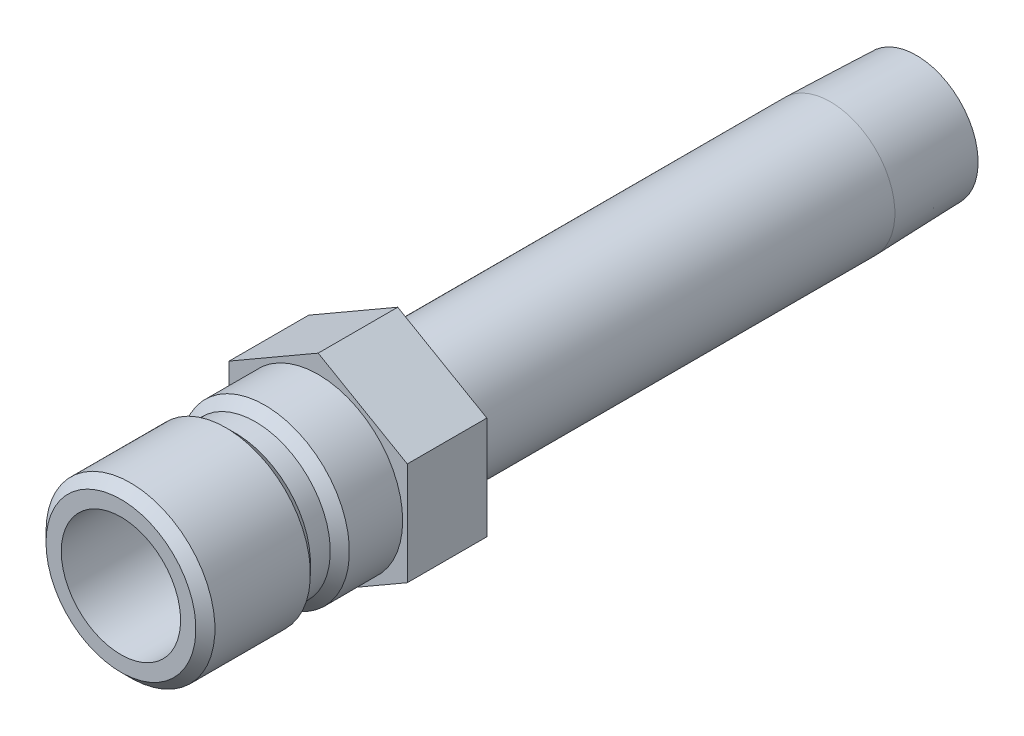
from build123d import *

# Parameters (mm, degrees)
SKETCH2_R           = 4.7625
BOSS_EXTRUDE1_DEPTH = 6.35


with BuildPart() as part:
    # Sketch1 → Revolve1 (revolve)
    with BuildSketch(Plane(origin=(0, 0, 0), x_dir=(0, 0, -1), z_dir=(1, 0, 0)), mode=Mode.PRIVATE) as revolve1_sk:
        Polygon((-15.748, 4.7625), (-15.748, 5.9817), (-14.986, 6.7437), (-7.366, 6.7437), (-6.604, 5.9817), (-5.0165, 5.9817), (-4.2545, 6.7437), (6.35, 6.7437), (6.35, 5.1435), (40.894, 5.1435), (47.752, 4.929188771), (47.752, 3.4163), (-2.840212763, 3.4163), (-3.556, 4.7625), align=None)
    revolve(revolve1_sk.sketch.rotate(Axis((0, 0, -6.35), (0, 0, 1)), 90), axis=Axis((0, 0, -6.35), (0, 0, 1)))

    # Sketch2 → Boss-Extrude1 (add)
    with BuildSketch(Plane.XY):
        Polygon((-7.112, 4.106115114), (-7.112, -4.106115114), (0, -8.212230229), (7.112, -4.106115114), (7.112, 4.106115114), (0, 8.212230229), align=None)
        with Locations(Location((0, 0, 0), (0, 0, 180))):
            Circle(SKETCH2_R, mode=Mode.SUBTRACT)
    extrude(amount=-BOSS_EXTRUDE1_DEPTH)


solid = part.part
